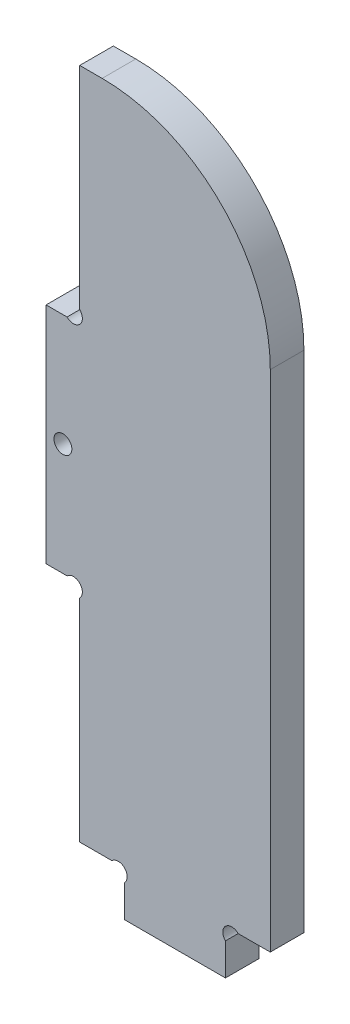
ISO-10303-21;
HEADER;
FILE_DESCRIPTION(('STEP AP214'),'2;1');
FILE_NAME('part.step','',(''),(''),'','','');
FILE_SCHEMA(('AUTOMOTIVE_DESIGN { 1 0 10303 214 1 1 1 1 }'));
ENDSEC;
DATA;
#1=APPLICATION_CONTEXT('core data for automotive mechanical design processes');
#2=APPLICATION_PROTOCOL_DEFINITION('international standard','automotive_design',2000,#1);
#3=PRODUCT_CONTEXT('',#1,'mechanical');
#4=PRODUCT('Part','Part','',(#3));
#5=PRODUCT_RELATED_PRODUCT_CATEGORY('part','',(#4));
#6=PRODUCT_DEFINITION_FORMATION('','',#4);
#7=PRODUCT_DEFINITION_CONTEXT('part definition',#1,'design');
#8=PRODUCT_DEFINITION('design','',#6,#7);
#9=PRODUCT_DEFINITION_SHAPE('','',#8);
#10=(LENGTH_UNIT() NAMED_UNIT(*) SI_UNIT(.MILLI.,.METRE.));
#11=(NAMED_UNIT(*) PLANE_ANGLE_UNIT() SI_UNIT($,.RADIAN.));
#12=(NAMED_UNIT(*) SI_UNIT($,.STERADIAN.) SOLID_ANGLE_UNIT());
#13=UNCERTAINTY_MEASURE_WITH_UNIT(LENGTH_MEASURE(1.E-05),#10,'distance_accuracy_value','');
#14=(GEOMETRIC_REPRESENTATION_CONTEXT(3) GLOBAL_UNCERTAINTY_ASSIGNED_CONTEXT((#13)) GLOBAL_UNIT_ASSIGNED_CONTEXT((#10,
#11,#12)) REPRESENTATION_CONTEXT('',''));
#15=CARTESIAN_POINT('',(0.,0.,0.));
#16=DIRECTION('',(0.,0.,1.));
#17=DIRECTION('',(1.,0.,0.));
#18=AXIS2_PLACEMENT_3D('',#15,#16,#17);
#19=CARTESIAN_POINT('',(4.86862915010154,48.8686291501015,6.));
#20=DIRECTION('',(0.,0.,-1.));
#21=DIRECTION('',(-1.,0.,0.));
#22=AXIS2_PLACEMENT_3D('',#19,#20,#21);
#23=PLANE('',#22);
#24=DIRECTION('',(1.,0.,0.));
#25=VECTOR('',#24,1.);
#26=CARTESIAN_POINT('',(11.737258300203,10.,6.));
#27=LINE('',#26,#25);
#28=CARTESIAN_POINT('',(6.,9.99999999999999,6.));
#29=VERTEX_POINT('',#28);
#30=CARTESIAN_POINT('',(11.737258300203,10.,6.));
#31=VERTEX_POINT('',#30);
#32=EDGE_CURVE('E201',#29,#31,#27,.T.);
#33=ORIENTED_EDGE('',*,*,#32,.T.);
#34=CARTESIAN_POINT('',(12.8686291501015,8.86862915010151,6.));
#35=DIRECTION('',(0.,0.,-1.));
#36=DIRECTION('',(1.,0.,0.));
#37=AXIS2_PLACEMENT_3D('',#34,#35,#36);
#38=CIRCLE('',#37,1.60000000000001);
#39=CARTESIAN_POINT('',(14.,7.73725830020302,6.));
#40=VERTEX_POINT('',#39);
#41=EDGE_CURVE('E104',#31,#40,#38,.T.);
#42=ORIENTED_EDGE('',*,*,#41,.T.);
#43=DIRECTION('',(0.,-1.,0.));
#44=VECTOR('',#43,1.);
#45=CARTESIAN_POINT('',(14.,7.73725830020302,6.));
#46=LINE('',#45,#44);
#47=CARTESIAN_POINT('',(14.,2.,6.));
#48=VERTEX_POINT('',#47);
#49=EDGE_CURVE('E243',#40,#48,#46,.T.);
#50=ORIENTED_EDGE('',*,*,#49,.T.);
#51=DIRECTION('',(1.,0.,0.));
#52=VECTOR('',#51,1.);
#53=CARTESIAN_POINT('',(14.,2.,6.));
#54=LINE('',#53,#52);
#55=CARTESIAN_POINT('',(32.,2.,6.));
#56=VERTEX_POINT('',#55);
#57=EDGE_CURVE('E262',#48,#56,#54,.T.);
#58=ORIENTED_EDGE('',*,*,#57,.T.);
#59=DIRECTION('',(0.,1.,0.));
#60=VECTOR('',#59,1.);
#61=CARTESIAN_POINT('',(32.,7.73725830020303,6.));
#62=LINE('',#61,#60);
#63=CARTESIAN_POINT('',(32.,7.73725830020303,6.));
#64=VERTEX_POINT('',#63);
#65=EDGE_CURVE('E259',#56,#64,#62,.T.);
#66=ORIENTED_EDGE('',*,*,#65,.T.);
#67=CARTESIAN_POINT('',(33.1313708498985,8.86862915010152,6.));
#68=DIRECTION('',(0.,0.,-1.));
#69=DIRECTION('',(-1.,0.,0.));
#70=AXIS2_PLACEMENT_3D('',#67,#68,#69);
#71=CIRCLE('',#70,1.60000000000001);
#72=CARTESIAN_POINT('',(34.2627416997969,10.,6.));
#73=VERTEX_POINT('',#72);
#74=EDGE_CURVE('E261',#64,#73,#71,.T.);
#75=ORIENTED_EDGE('',*,*,#74,.T.);
#76=DIRECTION('',(1.,0.,0.));
#77=VECTOR('',#76,1.);
#78=CARTESIAN_POINT('',(34.2627416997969,10.,6.));
#79=LINE('',#78,#77);
#80=CARTESIAN_POINT('',(40.,10.,6.));
#81=VERTEX_POINT('',#80);
#82=EDGE_CURVE('E264',#73,#81,#79,.T.);
#83=ORIENTED_EDGE('',*,*,#82,.T.);
#84=DIRECTION('',(0.,1.,0.));
#85=VECTOR('',#84,1.);
#86=CARTESIAN_POINT('',(40.,10.,6.));
#87=LINE('',#86,#85);
#88=CARTESIAN_POINT('',(40.,99.9999999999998,6.));
#89=VERTEX_POINT('',#88);
#90=EDGE_CURVE('E270',#81,#89,#87,.T.);
#91=ORIENTED_EDGE('',*,*,#90,.T.);
#92=CARTESIAN_POINT('',(10.,100.,6.));
#93=DIRECTION('',(0.,0.,1.));
#94=DIRECTION('',(-1.,0.,0.));
#95=AXIS2_PLACEMENT_3D('',#92,#93,#94);
#96=CIRCLE('',#95,30.);
#97=CARTESIAN_POINT('',(9.99999999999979,130.,6.));
#98=VERTEX_POINT('',#97);
#99=EDGE_CURVE('E272',#89,#98,#96,.T.);
#100=ORIENTED_EDGE('',*,*,#99,.T.);
#101=DIRECTION('',(-1.,0.,0.));
#102=VECTOR('',#101,1.);
#103=CARTESIAN_POINT('',(6.,130.,6.));
#104=LINE('',#103,#102);
#105=CARTESIAN_POINT('',(6.,130.,6.));
#106=VERTEX_POINT('',#105);
#107=EDGE_CURVE('E274',#98,#106,#104,.T.);
#108=ORIENTED_EDGE('',*,*,#107,.T.);
#109=DIRECTION('',(0.,-1.,0.));
#110=VECTOR('',#109,1.);
#111=CARTESIAN_POINT('',(6.,92.2627416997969,6.));
#112=LINE('',#111,#110);
#113=CARTESIAN_POINT('',(6.00000000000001,92.2627416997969,6.));
#114=VERTEX_POINT('',#113);
#115=EDGE_CURVE('E276',#106,#114,#112,.T.);
#116=ORIENTED_EDGE('',*,*,#115,.T.);
#117=CARTESIAN_POINT('',(4.86862915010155,91.1313708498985,6.));
#118=DIRECTION('',(0.,0.,-1.));
#119=DIRECTION('',(1.,0.,0.));
#120=AXIS2_PLACEMENT_3D('',#117,#118,#119);
#121=CIRCLE('',#120,1.59999999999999);
#122=CARTESIAN_POINT('',(3.7372583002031,90.,6.));
#123=VERTEX_POINT('',#122);
#124=EDGE_CURVE('E278',#114,#123,#121,.T.);
#125=ORIENTED_EDGE('',*,*,#124,.T.);
#126=DIRECTION('',(-1.,0.,0.));
#127=VECTOR('',#126,1.);
#128=CARTESIAN_POINT('',(3.7372583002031,90.,6.));
#129=LINE('',#128,#127);
#130=CARTESIAN_POINT('',(0.,90.,6.));
#131=VERTEX_POINT('',#130);
#132=EDGE_CURVE('E280',#123,#131,#129,.T.);
#133=ORIENTED_EDGE('',*,*,#132,.T.);
#134=DIRECTION('',(0.,-1.,0.));
#135=VECTOR('',#134,1.);
#136=CARTESIAN_POINT('',(0.,90.,6.));
#137=LINE('',#136,#135);
#138=CARTESIAN_POINT('',(0.,50.,6.));
#139=VERTEX_POINT('',#138);
#140=EDGE_CURVE('E150',#131,#139,#137,.T.);
#141=ORIENTED_EDGE('',*,*,#140,.T.);
#142=DIRECTION('',(1.,0.,0.));
#143=VECTOR('',#142,1.);
#144=CARTESIAN_POINT('',(3.73725830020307,50.,6.));
#145=LINE('',#144,#143);
#146=CARTESIAN_POINT('',(3.73725830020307,50.,6.));
#147=VERTEX_POINT('',#146);
#148=EDGE_CURVE('E144',#139,#147,#145,.T.);
#149=ORIENTED_EDGE('',*,*,#148,.T.);
#150=CARTESIAN_POINT('',(4.86862915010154,48.8686291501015,6.));
#151=DIRECTION('',(0.,0.,-1.));
#152=DIRECTION('',(-1.,0.,0.));
#153=AXIS2_PLACEMENT_3D('',#150,#151,#152);
#154=CIRCLE('',#153,1.6);
#155=CARTESIAN_POINT('',(6.,47.737258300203,6.));
#156=VERTEX_POINT('',#155);
#157=EDGE_CURVE('E148',#147,#156,#154,.T.);
#158=ORIENTED_EDGE('',*,*,#157,.T.);
#159=DIRECTION('',(0.,-1.,0.));
#160=VECTOR('',#159,1.);
#161=CARTESIAN_POINT('',(6.,47.737258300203,6.));
#162=LINE('',#161,#160);
#163=EDGE_CURVE('E34',#156,#29,#162,.T.);
#164=ORIENTED_EDGE('',*,*,#163,.T.);
#165=EDGE_LOOP('',(#33,#42,#50,#58,#66,#75,#83,#91,#100,#108,#116,#125,#133,#141,#149,#158,#164));
#166=FACE_BOUND('',#165,.T.);
#167=CARTESIAN_POINT('',(3.,70.,6.));
#168=DIRECTION('',(0.,0.,1.));
#169=DIRECTION('',(1.,0.,0.));
#170=AXIS2_PLACEMENT_3D('',#167,#168,#169);
#171=CIRCLE('',#170,1.6);
#172=CARTESIAN_POINT('',(4.6,70.,6.));
#173=VERTEX_POINT('',#172);
#174=EDGE_CURVE('E172',#173,#173,#171,.T.);
#175=ORIENTED_EDGE('',*,*,#174,.F.);
#176=EDGE_LOOP('',(#175));
#177=FACE_BOUND('',#176,.T.);
#178=ADVANCED_FACE('F17',(#166,#177),#23,.F.);
#179=CARTESIAN_POINT('',(4.86862915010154,48.8686291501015,0.));
#180=DIRECTION('',(0.,0.,-1.));
#181=DIRECTION('',(-1.,0.,0.));
#182=AXIS2_PLACEMENT_3D('',#179,#180,#181);
#183=PLANE('',#182);
#184=DIRECTION('',(1.,0.,0.));
#185=VECTOR('',#184,1.);
#186=CARTESIAN_POINT('',(11.737258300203,10.,0.));
#187=LINE('',#186,#185);
#188=CARTESIAN_POINT('',(6.,9.99999999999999,0.));
#189=VERTEX_POINT('',#188);
#190=CARTESIAN_POINT('',(11.737258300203,10.,0.));
#191=VERTEX_POINT('',#190);
#192=EDGE_CURVE('E168',#189,#191,#187,.T.);
#193=ORIENTED_EDGE('',*,*,#192,.F.);
#194=DIRECTION('',(0.,-1.,0.));
#195=VECTOR('',#194,1.);
#196=CARTESIAN_POINT('',(6.,47.737258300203,0.));
#197=LINE('',#196,#195);
#198=CARTESIAN_POINT('',(6.,47.737258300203,0.));
#199=VERTEX_POINT('',#198);
#200=EDGE_CURVE('E96',#199,#189,#197,.T.);
#201=ORIENTED_EDGE('',*,*,#200,.F.);
#202=CARTESIAN_POINT('',(4.86862915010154,48.8686291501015,0.));
#203=DIRECTION('',(0.,0.,-1.));
#204=DIRECTION('',(-1.,0.,0.));
#205=AXIS2_PLACEMENT_3D('',#202,#203,#204);
#206=CIRCLE('',#205,1.6);
#207=CARTESIAN_POINT('',(3.73725830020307,50.,0.));
#208=VERTEX_POINT('',#207);
#209=EDGE_CURVE('E90',#208,#199,#206,.T.);
#210=ORIENTED_EDGE('',*,*,#209,.F.);
#211=DIRECTION('',(1.,0.,0.));
#212=VECTOR('',#211,1.);
#213=CARTESIAN_POINT('',(3.73725830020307,50.,0.));
#214=LINE('',#213,#212);
#215=CARTESIAN_POINT('',(0.,50.,0.));
#216=VERTEX_POINT('',#215);
#217=EDGE_CURVE('E158',#216,#208,#214,.T.);
#218=ORIENTED_EDGE('',*,*,#217,.F.);
#219=DIRECTION('',(0.,-1.,0.));
#220=VECTOR('',#219,1.);
#221=CARTESIAN_POINT('',(0.,90.,0.));
#222=LINE('',#221,#220);
#223=CARTESIAN_POINT('',(0.,90.,0.));
#224=VERTEX_POINT('',#223);
#225=EDGE_CURVE('E196',#224,#216,#222,.T.);
#226=ORIENTED_EDGE('',*,*,#225,.F.);
#227=DIRECTION('',(-1.,0.,0.));
#228=VECTOR('',#227,1.);
#229=CARTESIAN_POINT('',(3.7372583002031,90.,0.));
#230=LINE('',#229,#228);
#231=CARTESIAN_POINT('',(3.7372583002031,90.,0.));
#232=VERTEX_POINT('',#231);
#233=EDGE_CURVE('E194',#232,#224,#230,.T.);
#234=ORIENTED_EDGE('',*,*,#233,.F.);
#235=CARTESIAN_POINT('',(4.86862915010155,91.1313708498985,0.));
#236=DIRECTION('',(0.,0.,-1.));
#237=DIRECTION('',(1.,0.,0.));
#238=AXIS2_PLACEMENT_3D('',#235,#236,#237);
#239=CIRCLE('',#238,1.59999999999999);
#240=CARTESIAN_POINT('',(6.00000000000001,92.2627416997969,0.));
#241=VERTEX_POINT('',#240);
#242=EDGE_CURVE('E192',#241,#232,#239,.T.);
#243=ORIENTED_EDGE('',*,*,#242,.F.);
#244=DIRECTION('',(0.,-1.,0.));
#245=VECTOR('',#244,1.);
#246=CARTESIAN_POINT('',(6.,92.2627416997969,0.));
#247=LINE('',#246,#245);
#248=CARTESIAN_POINT('',(6.,130.,0.));
#249=VERTEX_POINT('',#248);
#250=EDGE_CURVE('E190',#249,#241,#247,.T.);
#251=ORIENTED_EDGE('',*,*,#250,.F.);
#252=DIRECTION('',(-1.,0.,0.));
#253=VECTOR('',#252,1.);
#254=CARTESIAN_POINT('',(6.,130.,0.));
#255=LINE('',#254,#253);
#256=CARTESIAN_POINT('',(9.99999999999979,130.,0.));
#257=VERTEX_POINT('',#256);
#258=EDGE_CURVE('E188',#257,#249,#255,.T.);
#259=ORIENTED_EDGE('',*,*,#258,.F.);
#260=CARTESIAN_POINT('',(10.,100.,0.));
#261=DIRECTION('',(0.,0.,1.));
#262=DIRECTION('',(-1.,0.,0.));
#263=AXIS2_PLACEMENT_3D('',#260,#261,#262);
#264=CIRCLE('',#263,30.);
#265=CARTESIAN_POINT('',(40.,99.9999999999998,0.));
#266=VERTEX_POINT('',#265);
#267=EDGE_CURVE('E186',#266,#257,#264,.T.);
#268=ORIENTED_EDGE('',*,*,#267,.F.);
#269=DIRECTION('',(0.,1.,0.));
#270=VECTOR('',#269,1.);
#271=CARTESIAN_POINT('',(40.,10.,0.));
#272=LINE('',#271,#270);
#273=CARTESIAN_POINT('',(40.,10.,0.));
#274=VERTEX_POINT('',#273);
#275=EDGE_CURVE('E184',#274,#266,#272,.T.);
#276=ORIENTED_EDGE('',*,*,#275,.F.);
#277=DIRECTION('',(1.,0.,0.));
#278=VECTOR('',#277,1.);
#279=CARTESIAN_POINT('',(34.2627416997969,10.,0.));
#280=LINE('',#279,#278);
#281=CARTESIAN_POINT('',(34.2627416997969,10.,0.));
#282=VERTEX_POINT('',#281);
#283=EDGE_CURVE('E182',#282,#274,#280,.T.);
#284=ORIENTED_EDGE('',*,*,#283,.F.);
#285=CARTESIAN_POINT('',(33.1313708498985,8.86862915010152,0.));
#286=DIRECTION('',(0.,0.,-1.));
#287=DIRECTION('',(-1.,0.,0.));
#288=AXIS2_PLACEMENT_3D('',#285,#286,#287);
#289=CIRCLE('',#288,1.60000000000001);
#290=CARTESIAN_POINT('',(32.,7.73725830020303,0.));
#291=VERTEX_POINT('',#290);
#292=EDGE_CURVE('E180',#291,#282,#289,.T.);
#293=ORIENTED_EDGE('',*,*,#292,.F.);
#294=DIRECTION('',(0.,1.,0.));
#295=VECTOR('',#294,1.);
#296=CARTESIAN_POINT('',(32.,7.73725830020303,0.));
#297=LINE('',#296,#295);
#298=CARTESIAN_POINT('',(32.,2.,0.));
#299=VERTEX_POINT('',#298);
#300=EDGE_CURVE('E178',#299,#291,#297,.T.);
#301=ORIENTED_EDGE('',*,*,#300,.F.);
#302=DIRECTION('',(1.,0.,0.));
#303=VECTOR('',#302,1.);
#304=CARTESIAN_POINT('',(14.,2.,0.));
#305=LINE('',#304,#303);
#306=CARTESIAN_POINT('',(14.,2.,0.));
#307=VERTEX_POINT('',#306);
#308=EDGE_CURVE('E176',#307,#299,#305,.T.);
#309=ORIENTED_EDGE('',*,*,#308,.F.);
#310=DIRECTION('',(0.,-1.,0.));
#311=VECTOR('',#310,1.);
#312=CARTESIAN_POINT('',(14.,7.73725830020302,0.));
#313=LINE('',#312,#311);
#314=CARTESIAN_POINT('',(14.,7.73725830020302,0.));
#315=VERTEX_POINT('',#314);
#316=EDGE_CURVE('E174',#315,#307,#313,.T.);
#317=ORIENTED_EDGE('',*,*,#316,.F.);
#318=CARTESIAN_POINT('',(12.8686291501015,8.86862915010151,0.));
#319=DIRECTION('',(0.,0.,-1.));
#320=DIRECTION('',(1.,0.,0.));
#321=AXIS2_PLACEMENT_3D('',#318,#319,#320);
#322=CIRCLE('',#321,1.60000000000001);
#323=EDGE_CURVE('E171',#191,#315,#322,.T.);
#324=ORIENTED_EDGE('',*,*,#323,.F.);
#325=EDGE_LOOP('',(#193,#201,#210,#218,#226,#234,#243,#251,#259,#268,#276,#284,#293,#301,#309,
#317,#324));
#326=FACE_BOUND('',#325,.T.);
#327=CARTESIAN_POINT('',(3.,70.,0.));
#328=DIRECTION('',(0.,0.,1.));
#329=DIRECTION('',(1.,0.,0.));
#330=AXIS2_PLACEMENT_3D('',#327,#328,#329);
#331=CIRCLE('',#330,1.6);
#332=CARTESIAN_POINT('',(4.6,70.,0.));
#333=VERTEX_POINT('',#332);
#334=EDGE_CURVE('E500',#333,#333,#331,.T.);
#335=ORIENTED_EDGE('',*,*,#334,.T.);
#336=EDGE_LOOP('',(#335));
#337=FACE_BOUND('',#336,.T.);
#338=ADVANCED_FACE('F247',(#326,#337),#183,.T.);
#339=CARTESIAN_POINT('',(11.737258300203,10.,6.));
#340=DIRECTION('',(0.,1.,0.));
#341=DIRECTION('',(-1.,0.,0.));
#342=AXIS2_PLACEMENT_3D('',#339,#340,#341);
#343=PLANE('',#342);
#344=ORIENTED_EDGE('',*,*,#192,.T.);
#345=DIRECTION('',(0.,0.,-1.));
#346=VECTOR('',#345,1.);
#347=CARTESIAN_POINT('',(11.737258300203,10.,6.));
#348=LINE('',#347,#346);
#349=EDGE_CURVE('E11',#31,#191,#348,.T.);
#350=ORIENTED_EDGE('',*,*,#349,.F.);
#351=ORIENTED_EDGE('',*,*,#32,.F.);
#352=DIRECTION('',(0.,0.,-1.));
#353=VECTOR('',#352,1.);
#354=CARTESIAN_POINT('',(6.,9.99999999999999,6.));
#355=LINE('',#354,#353);
#356=EDGE_CURVE('E164',#29,#189,#355,.T.);
#357=ORIENTED_EDGE('',*,*,#356,.T.);
#358=EDGE_LOOP('',(#344,#350,#351,#357));
#359=FACE_BOUND('',#358,.T.);
#360=ADVANCED_FACE('F19',(#359),#343,.F.);
#361=CARTESIAN_POINT('',(12.8686291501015,8.86862915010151,6.));
#362=DIRECTION('',(0.,0.,-1.));
#363=DIRECTION('',(-1.,0.,0.));
#364=AXIS2_PLACEMENT_3D('',#361,#362,#363);
#365=CYLINDRICAL_SURFACE('',#364,1.60000000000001);
#366=ORIENTED_EDGE('',*,*,#323,.T.);
#367=DIRECTION('',(0.,0.,-1.));
#368=VECTOR('',#367,1.);
#369=CARTESIAN_POINT('',(14.,7.73725830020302,6.));
#370=LINE('',#369,#368);
#371=EDGE_CURVE('E26',#40,#315,#370,.T.);
#372=ORIENTED_EDGE('',*,*,#371,.F.);
#373=ORIENTED_EDGE('',*,*,#41,.F.);
#374=ORIENTED_EDGE('',*,*,#349,.T.);
#375=EDGE_LOOP('',(#366,#372,#373,#374));
#376=FACE_BOUND('',#375,.T.);
#377=ADVANCED_FACE('F318',(#376),#365,.F.);
#378=CARTESIAN_POINT('',(14.,7.73725830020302,6.));
#379=DIRECTION('',(1.,0.,0.));
#380=DIRECTION('',(0.,1.,0.));
#381=AXIS2_PLACEMENT_3D('',#378,#379,#380);
#382=PLANE('',#381);
#383=ORIENTED_EDGE('',*,*,#316,.T.);
#384=DIRECTION('',(0.,0.,-1.));
#385=VECTOR('',#384,1.);
#386=CARTESIAN_POINT('',(14.,2.,6.));
#387=LINE('',#386,#385);
#388=EDGE_CURVE('E235',#48,#307,#387,.T.);
#389=ORIENTED_EDGE('',*,*,#388,.F.);
#390=ORIENTED_EDGE('',*,*,#49,.F.);
#391=ORIENTED_EDGE('',*,*,#371,.T.);
#392=EDGE_LOOP('',(#383,#389,#390,#391));
#393=FACE_BOUND('',#392,.T.);
#394=ADVANCED_FACE('F241',(#393),#382,.F.);
#395=CARTESIAN_POINT('',(14.,2.,6.));
#396=DIRECTION('',(0.,1.,0.));
#397=DIRECTION('',(0.,0.,1.));
#398=AXIS2_PLACEMENT_3D('',#395,#396,#397);
#399=PLANE('',#398);
#400=ORIENTED_EDGE('',*,*,#308,.T.);
#401=DIRECTION('',(0.,0.,-1.));
#402=VECTOR('',#401,1.);
#403=CARTESIAN_POINT('',(32.,2.,6.));
#404=LINE('',#403,#402);
#405=EDGE_CURVE('E232',#56,#299,#404,.T.);
#406=ORIENTED_EDGE('',*,*,#405,.F.);
#407=ORIENTED_EDGE('',*,*,#57,.F.);
#408=ORIENTED_EDGE('',*,*,#388,.T.);
#409=EDGE_LOOP('',(#400,#406,#407,#408));
#410=FACE_BOUND('',#409,.T.);
#411=ADVANCED_FACE('F253',(#410),#399,.F.);
#412=CARTESIAN_POINT('',(32.,7.73725830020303,6.));
#413=DIRECTION('',(-1.,0.,0.));
#414=DIRECTION('',(0.,0.,1.));
#415=AXIS2_PLACEMENT_3D('',#412,#413,#414);
#416=PLANE('',#415);
#417=ORIENTED_EDGE('',*,*,#300,.T.);
#418=DIRECTION('',(0.,0.,-1.));
#419=VECTOR('',#418,1.);
#420=CARTESIAN_POINT('',(32.,7.73725830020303,6.));
#421=LINE('',#420,#419);
#422=EDGE_CURVE('E229',#64,#291,#421,.T.);
#423=ORIENTED_EDGE('',*,*,#422,.F.);
#424=ORIENTED_EDGE('',*,*,#65,.F.);
#425=ORIENTED_EDGE('',*,*,#405,.T.);
#426=EDGE_LOOP('',(#417,#423,#424,#425));
#427=FACE_BOUND('',#426,.T.);
#428=ADVANCED_FACE('F257',(#427),#416,.F.);
#429=CARTESIAN_POINT('',(33.1313708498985,8.86862915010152,6.));
#430=DIRECTION('',(0.,0.,-1.));
#431=DIRECTION('',(-1.,0.,0.));
#432=AXIS2_PLACEMENT_3D('',#429,#430,#431);
#433=CYLINDRICAL_SURFACE('',#432,1.60000000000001);
#434=ORIENTED_EDGE('',*,*,#292,.T.);
#435=DIRECTION('',(0.,0.,-1.));
#436=VECTOR('',#435,1.);
#437=CARTESIAN_POINT('',(34.2627416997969,10.,6.));
#438=LINE('',#437,#436);
#439=EDGE_CURVE('E226',#73,#282,#438,.T.);
#440=ORIENTED_EDGE('',*,*,#439,.F.);
#441=ORIENTED_EDGE('',*,*,#74,.F.);
#442=ORIENTED_EDGE('',*,*,#422,.T.);
#443=EDGE_LOOP('',(#434,#440,#441,#442));
#444=FACE_BOUND('',#443,.T.);
#445=ADVANCED_FACE('F333',(#444),#433,.F.);
#446=CARTESIAN_POINT('',(34.2627416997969,10.,6.));
#447=DIRECTION('',(0.,1.,0.));
#448=DIRECTION('',(0.,0.,1.));
#449=AXIS2_PLACEMENT_3D('',#446,#447,#448);
#450=PLANE('',#449);
#451=ORIENTED_EDGE('',*,*,#283,.T.);
#452=DIRECTION('',(0.,0.,-1.));
#453=VECTOR('',#452,1.);
#454=CARTESIAN_POINT('',(40.,10.,6.));
#455=LINE('',#454,#453);
#456=EDGE_CURVE('E223',#81,#274,#455,.T.);
#457=ORIENTED_EDGE('',*,*,#456,.F.);
#458=ORIENTED_EDGE('',*,*,#82,.F.);
#459=ORIENTED_EDGE('',*,*,#439,.T.);
#460=EDGE_LOOP('',(#451,#457,#458,#459));
#461=FACE_BOUND('',#460,.T.);
#462=ADVANCED_FACE('F336',(#461),#450,.F.);
#463=CARTESIAN_POINT('',(40.,10.,6.));
#464=DIRECTION('',(-1.,0.,0.));
#465=DIRECTION('',(0.,0.,1.));
#466=AXIS2_PLACEMENT_3D('',#463,#464,#465);
#467=PLANE('',#466);
#468=ORIENTED_EDGE('',*,*,#275,.T.);
#469=DIRECTION('',(0.,0.,-1.));
#470=VECTOR('',#469,1.);
#471=CARTESIAN_POINT('',(40.,99.9999999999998,6.));
#472=LINE('',#471,#470);
#473=EDGE_CURVE('E220',#89,#266,#472,.T.);
#474=ORIENTED_EDGE('',*,*,#473,.F.);
#475=ORIENTED_EDGE('',*,*,#90,.F.);
#476=ORIENTED_EDGE('',*,*,#456,.T.);
#477=EDGE_LOOP('',(#468,#474,#475,#476));
#478=FACE_BOUND('',#477,.T.);
#479=ADVANCED_FACE('F340',(#478),#467,.F.);
#480=CARTESIAN_POINT('',(10.,100.,6.));
#481=DIRECTION('',(0.,0.,-1.));
#482=DIRECTION('',(-1.,0.,0.));
#483=AXIS2_PLACEMENT_3D('',#480,#481,#482);
#484=CYLINDRICAL_SURFACE('',#483,30.);
#485=ORIENTED_EDGE('',*,*,#267,.T.);
#486=DIRECTION('',(0.,0.,-1.));
#487=VECTOR('',#486,1.);
#488=CARTESIAN_POINT('',(9.99999999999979,130.,6.));
#489=LINE('',#488,#487);
#490=EDGE_CURVE('E217',#98,#257,#489,.T.);
#491=ORIENTED_EDGE('',*,*,#490,.F.);
#492=ORIENTED_EDGE('',*,*,#99,.F.);
#493=ORIENTED_EDGE('',*,*,#473,.T.);
#494=EDGE_LOOP('',(#485,#491,#492,#493));
#495=FACE_BOUND('',#494,.T.);
#496=ADVANCED_FACE('F344',(#495),#484,.T.);
#497=CARTESIAN_POINT('',(6.,130.,6.));
#498=DIRECTION('',(0.,-1.,0.));
#499=DIRECTION('',(0.,0.,-1.));
#500=AXIS2_PLACEMENT_3D('',#497,#498,#499);
#501=PLANE('',#500);
#502=ORIENTED_EDGE('',*,*,#258,.T.);
#503=DIRECTION('',(0.,0.,-1.));
#504=VECTOR('',#503,1.);
#505=CARTESIAN_POINT('',(6.,130.,6.));
#506=LINE('',#505,#504);
#507=EDGE_CURVE('E214',#106,#249,#506,.T.);
#508=ORIENTED_EDGE('',*,*,#507,.F.);
#509=ORIENTED_EDGE('',*,*,#107,.F.);
#510=ORIENTED_EDGE('',*,*,#490,.T.);
#511=EDGE_LOOP('',(#502,#508,#509,#510));
#512=FACE_BOUND('',#511,.T.);
#513=ADVANCED_FACE('F348',(#512),#501,.F.);
#514=CARTESIAN_POINT('',(6.,92.2627416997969,6.));
#515=DIRECTION('',(1.,0.,0.));
#516=DIRECTION('',(0.,1.,0.));
#517=AXIS2_PLACEMENT_3D('',#514,#515,#516);
#518=PLANE('',#517);
#519=ORIENTED_EDGE('',*,*,#250,.T.);
#520=DIRECTION('',(0.,0.,-1.));
#521=VECTOR('',#520,1.);
#522=CARTESIAN_POINT('',(6.00000000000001,92.2627416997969,6.));
#523=LINE('',#522,#521);
#524=EDGE_CURVE('E211',#114,#241,#523,.T.);
#525=ORIENTED_EDGE('',*,*,#524,.F.);
#526=ORIENTED_EDGE('',*,*,#115,.F.);
#527=ORIENTED_EDGE('',*,*,#507,.T.);
#528=EDGE_LOOP('',(#519,#525,#526,#527));
#529=FACE_BOUND('',#528,.T.);
#530=ADVANCED_FACE('F352',(#529),#518,.F.);
#531=CARTESIAN_POINT('',(4.86862915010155,91.1313708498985,6.));
#532=DIRECTION('',(0.,0.,-1.));
#533=DIRECTION('',(-1.,0.,0.));
#534=AXIS2_PLACEMENT_3D('',#531,#532,#533);
#535=CYLINDRICAL_SURFACE('',#534,1.59999999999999);
#536=ORIENTED_EDGE('',*,*,#242,.T.);
#537=DIRECTION('',(0.,0.,-1.));
#538=VECTOR('',#537,1.);
#539=CARTESIAN_POINT('',(3.7372583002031,90.,6.));
#540=LINE('',#539,#538);
#541=EDGE_CURVE('E208',#123,#232,#540,.T.);
#542=ORIENTED_EDGE('',*,*,#541,.F.);
#543=ORIENTED_EDGE('',*,*,#124,.F.);
#544=ORIENTED_EDGE('',*,*,#524,.T.);
#545=EDGE_LOOP('',(#536,#542,#543,#544));
#546=FACE_BOUND('',#545,.T.);
#547=ADVANCED_FACE('F356',(#546),#535,.F.);
#548=CARTESIAN_POINT('',(3.7372583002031,90.,6.));
#549=DIRECTION('',(0.,-1.,0.));
#550=DIRECTION('',(1.,0.,0.));
#551=AXIS2_PLACEMENT_3D('',#548,#549,#550);
#552=PLANE('',#551);
#553=ORIENTED_EDGE('',*,*,#233,.T.);
#554=DIRECTION('',(0.,0.,-1.));
#555=VECTOR('',#554,1.);
#556=CARTESIAN_POINT('',(0.,90.,6.));
#557=LINE('',#556,#555);
#558=EDGE_CURVE('E205',#131,#224,#557,.T.);
#559=ORIENTED_EDGE('',*,*,#558,.F.);
#560=ORIENTED_EDGE('',*,*,#132,.F.);
#561=ORIENTED_EDGE('',*,*,#541,.T.);
#562=EDGE_LOOP('',(#553,#559,#560,#561));
#563=FACE_BOUND('',#562,.T.);
#564=ADVANCED_FACE('F286',(#563),#552,.F.);
#565=CARTESIAN_POINT('',(0.,90.,6.));
#566=DIRECTION('',(1.,0.,0.));
#567=DIRECTION('',(0.,0.,-1.));
#568=AXIS2_PLACEMENT_3D('',#565,#566,#567);
#569=PLANE('',#568);
#570=ORIENTED_EDGE('',*,*,#225,.T.);
#571=DIRECTION('',(0.,0.,-1.));
#572=VECTOR('',#571,1.);
#573=CARTESIAN_POINT('',(0.,50.,6.));
#574=LINE('',#573,#572);
#575=EDGE_CURVE('E159',#139,#216,#574,.T.);
#576=ORIENTED_EDGE('',*,*,#575,.F.);
#577=ORIENTED_EDGE('',*,*,#140,.F.);
#578=ORIENTED_EDGE('',*,*,#558,.T.);
#579=EDGE_LOOP('',(#570,#576,#577,#578));
#580=FACE_BOUND('',#579,.T.);
#581=ADVANCED_FACE('F290',(#580),#569,.F.);
#582=CARTESIAN_POINT('',(3.73725830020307,50.,6.));
#583=DIRECTION('',(0.,1.,0.));
#584=DIRECTION('',(0.,0.,1.));
#585=AXIS2_PLACEMENT_3D('',#582,#583,#584);
#586=PLANE('',#585);
#587=ORIENTED_EDGE('',*,*,#217,.T.);
#588=DIRECTION('',(0.,0.,-1.));
#589=VECTOR('',#588,1.);
#590=CARTESIAN_POINT('',(3.73725830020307,50.,6.));
#591=LINE('',#590,#589);
#592=EDGE_CURVE('E155',#147,#208,#591,.T.);
#593=ORIENTED_EDGE('',*,*,#592,.F.);
#594=ORIENTED_EDGE('',*,*,#148,.F.);
#595=ORIENTED_EDGE('',*,*,#575,.T.);
#596=EDGE_LOOP('',(#587,#593,#594,#595));
#597=FACE_BOUND('',#596,.T.);
#598=ADVANCED_FACE('F156',(#597),#586,.F.);
#599=CARTESIAN_POINT('',(4.86862915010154,48.8686291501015,6.));
#600=DIRECTION('',(0.,0.,-1.));
#601=DIRECTION('',(-1.,0.,0.));
#602=AXIS2_PLACEMENT_3D('',#599,#600,#601);
#603=CYLINDRICAL_SURFACE('',#602,1.6);
#604=ORIENTED_EDGE('',*,*,#209,.T.);
#605=DIRECTION('',(0.,0.,-1.));
#606=VECTOR('',#605,1.);
#607=CARTESIAN_POINT('',(6.,47.737258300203,6.));
#608=LINE('',#607,#606);
#609=EDGE_CURVE('E160',#156,#199,#608,.T.);
#610=ORIENTED_EDGE('',*,*,#609,.F.);
#611=ORIENTED_EDGE('',*,*,#157,.F.);
#612=ORIENTED_EDGE('',*,*,#592,.T.);
#613=EDGE_LOOP('',(#604,#610,#611,#612));
#614=FACE_BOUND('',#613,.T.);
#615=ADVANCED_FACE('F162',(#614),#603,.F.);
#616=CARTESIAN_POINT('',(6.,47.737258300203,6.));
#617=DIRECTION('',(1.,0.,0.));
#618=DIRECTION('',(0.,0.,-1.));
#619=AXIS2_PLACEMENT_3D('',#616,#617,#618);
#620=PLANE('',#619);
#621=ORIENTED_EDGE('',*,*,#200,.T.);
#622=ORIENTED_EDGE('',*,*,#356,.F.);
#623=ORIENTED_EDGE('',*,*,#163,.F.);
#624=ORIENTED_EDGE('',*,*,#609,.T.);
#625=EDGE_LOOP('',(#621,#622,#623,#624));
#626=FACE_BOUND('',#625,.T.);
#627=ADVANCED_FACE('F294',(#626),#620,.F.);
#628=CARTESIAN_POINT('',(3.,70.,6.));
#629=DIRECTION('',(0.,0.,-1.));
#630=DIRECTION('',(-1.,0.,0.));
#631=AXIS2_PLACEMENT_3D('',#628,#629,#630);
#632=CYLINDRICAL_SURFACE('',#631,1.6);
#633=ORIENTED_EDGE('',*,*,#174,.T.);
#634=EDGE_LOOP('',(#633));
#635=FACE_BOUND('',#634,.T.);
#636=ORIENTED_EDGE('',*,*,#334,.F.);
#637=EDGE_LOOP('',(#636));
#638=FACE_BOUND('',#637,.T.);
#639=ADVANCED_FACE('F296',(#635,#638),#632,.F.);
#640=CLOSED_SHELL('',(#178,#338,#360,#377,#394,#411,#428,#445,#462,#479,#496,#513,#530,#547,
#564,#581,#598,#615,#627,#639));
#641=MANIFOLD_SOLID_BREP('B1',#640);
#642=ADVANCED_BREP_SHAPE_REPRESENTATION('',(#18,#641),#14);
#643=SHAPE_DEFINITION_REPRESENTATION(#9,#642);
ENDSEC;
END-ISO-10303-21;
